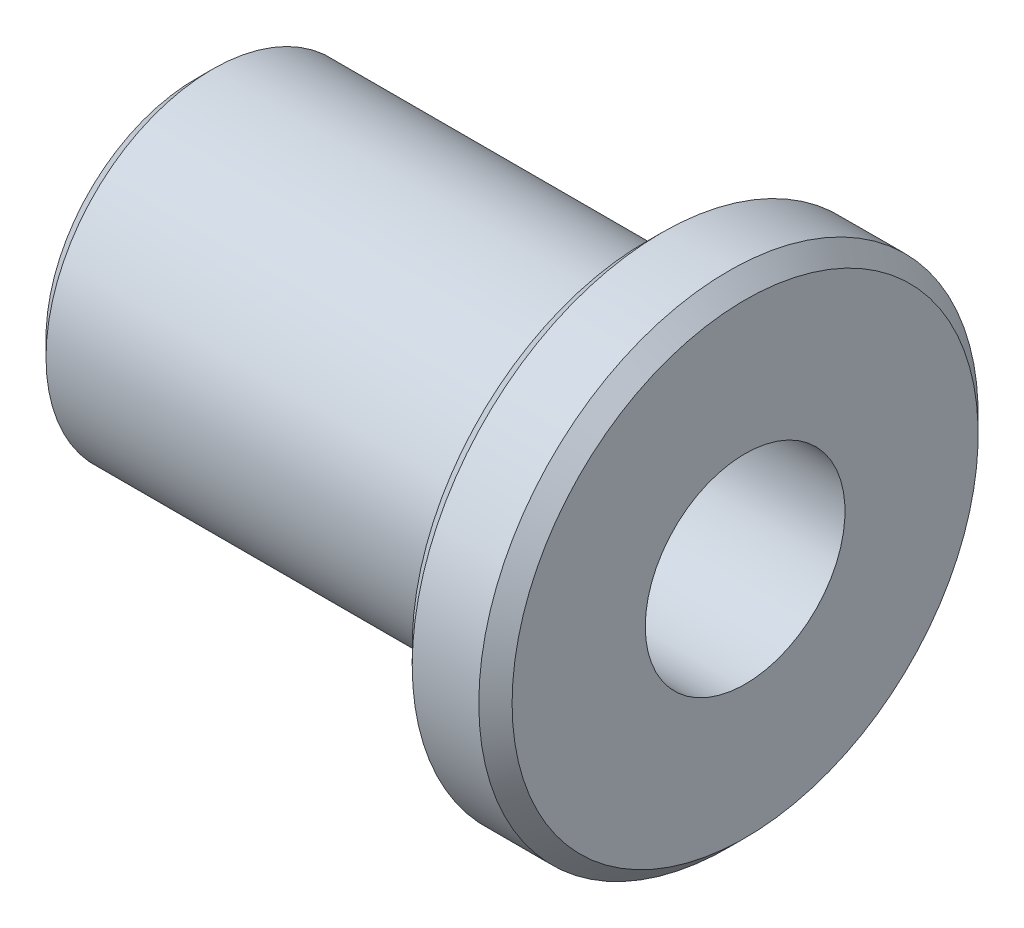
from build123d import *

# Parameters (mm, degrees)
CHANFREIN1_SIZE = 0.5


with BuildPart() as part:
    # Esquisse1 → Base-R_volution (revolve)
    with BuildSketch(Plane.XY, mode=Mode.PRIVATE) as base_r_volution_sk:
        Polygon((0, 3), (0, 5), (13.5, 5), (13.5, 7.5), (16.5, 7.5), (16.5, 3), align=None)
    revolve(base_r_volution_sk.sketch.rotate(Axis((0, 0, 0), (1, 0, 0)), 90), axis=Axis((0, 0, 0), (1, 0, 0)))

    # Chanfrein1
    chanfrein1_edges = [part.edges().sort_by_distance(p)[0] for p in [
        (0, 0, -3),
        (0, 0, -5),
        (13.5, 0, -7.5),
        (16.5, 0, -7.5),
    ]]
    chamfer(chanfrein1_edges, length=CHANFREIN1_SIZE)


solid = part.part
